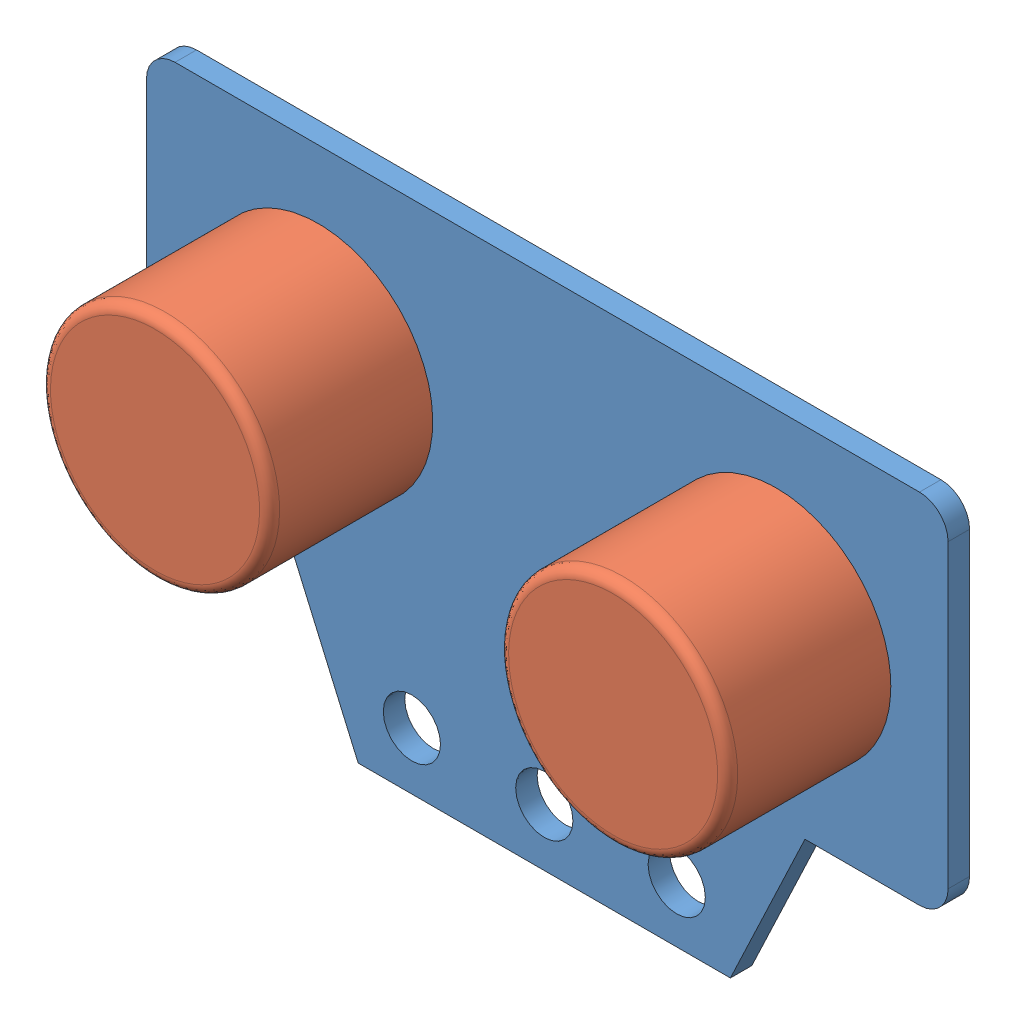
SolidWorks assembly Assemblage carte ultrasons.SLDASM, configuration Défaut (file format 8000). Lengths in mm.
Overall size (56 36 12.9).
3 component instances, 2 part files, 2 mates.
Components (placement in the parent):
- carte ultrason-1: carte ultrason.SLDPRT [Défaut] at (-80.0358 11.7973 -0.75) size (56 36 1.5)
- Cylindre ultrasons-1: Cylindre ultrasons.SLDPRT [Predeterminado] at (-68.0358 24.0482 12.15) x (-0.161416 -0.986886 0) z (0 0 -1) size (16 16 12.4)
- Cylindre ultrasons-2: Cylindre ultrasons.SLDPRT [Predeterminado] at (-36.0358 24.0482 12.15) x (-0.574539 -0.818477 0) z (0 0 -1) size (16 16 12.4)
Mates (geometry in assembly coordinates):
- Coïncidente1: coincident anti-aligned: circle of carte ultrason-1; circle of Cylindre ultrasons-1
- Coïncidente2: coincident anti-aligned: circle of carte ultrason-1; circle of Cylindre ultrasons-2
